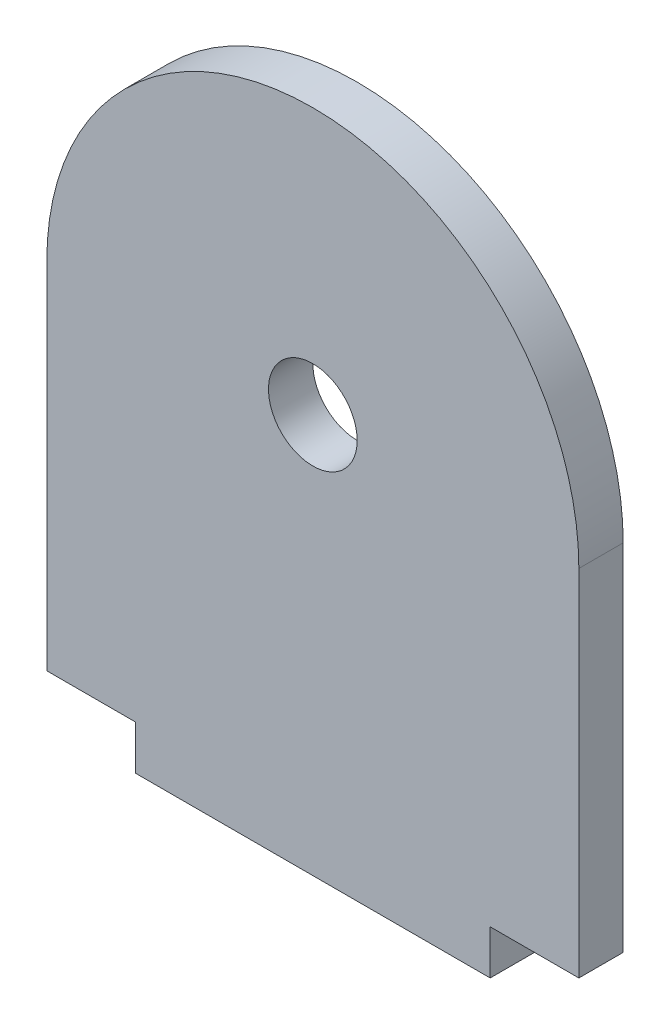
from build123d import *

# Parameters (mm, degrees)
SKETCH1_R           = 3.175
BOSS_EXTRUDE1_DEPTH = 3.175


with BuildPart() as part:
    # Sketch1 → Boss-Extrude1 (new body)
    with BuildSketch(Plane.XY):
        with BuildLine():
            Line((-28.454427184, -6.33944909), (-22.104427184, -6.33944909))
            Line((-22.104427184, -6.33944909), (-22.104427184, 19.06055091))
            ThreePointArc((-22.104427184, 19.06055091), (-41.154427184, 38.11055091), (-60.204427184, 19.06055091))
            Line((-60.204427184, 19.06055091), (-60.204427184, -6.33944909))
            Line((-60.204427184, -6.33944909), (-53.854427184, -6.33944909))
            Line((-53.854427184, -6.33944909), (-53.854427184, -9.51444909))
            Line((-53.854427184, -9.51444909), (-28.454427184, -9.51444909))
            Line((-28.454427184, -9.51444909), (-28.454427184, -6.33944909))
        make_face()
        with Locations((-41.154427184, 19.06055091)):
            Circle(SKETCH1_R, mode=Mode.SUBTRACT)
    extrude(amount=BOSS_EXTRUDE1_DEPTH)


solid = part.part
